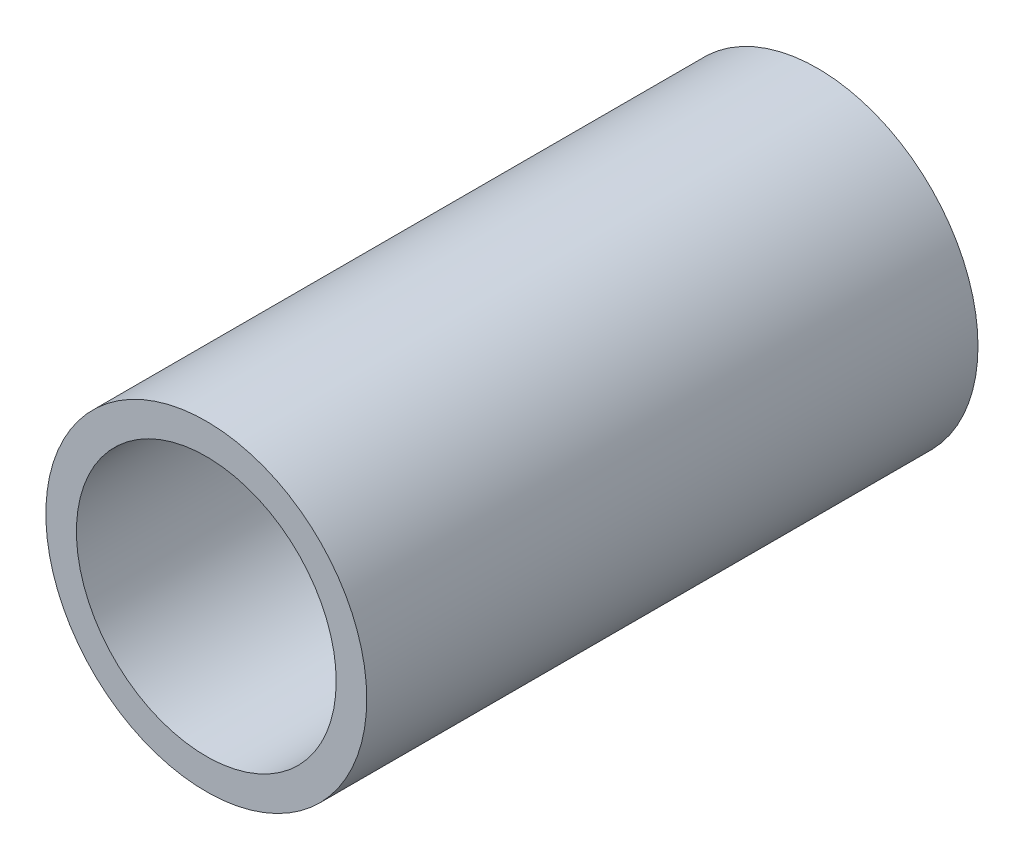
from build123d import *

# Parameters (mm, degrees)
SKETCH1_R           = 33.3375
SKETCH1_R_2         = 26.9875
BOSS_EXTRUDE1_DEPTH = 127


with BuildPart() as part:
    # Sketch1 → Boss-Extrude1 (new body)
    with BuildSketch(Plane.XY):
        Circle(SKETCH1_R)
        Circle(SKETCH1_R_2, mode=Mode.SUBTRACT)
    extrude(amount=BOSS_EXTRUDE1_DEPTH)


solid = part.part
